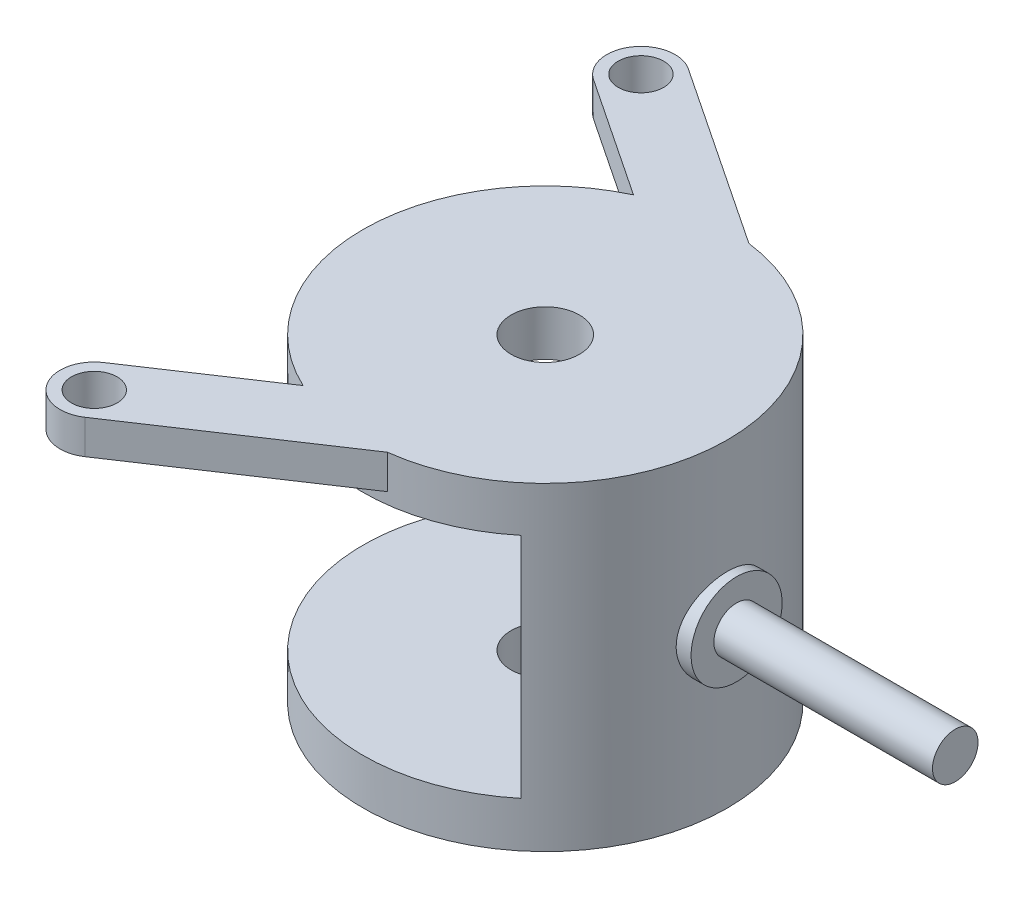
ISO-10303-21;
HEADER;
FILE_DESCRIPTION(('STEP AP214'),'2;1');
FILE_NAME('part.step','',(''),(''),'','','');
FILE_SCHEMA(('AUTOMOTIVE_DESIGN { 1 0 10303 214 1 1 1 1 }'));
ENDSEC;
DATA;
#1=APPLICATION_CONTEXT('core data for automotive mechanical design processes');
#2=APPLICATION_PROTOCOL_DEFINITION('international standard','automotive_design',2000,#1);
#3=PRODUCT_CONTEXT('',#1,'mechanical');
#4=PRODUCT('Part','Part','',(#3));
#5=PRODUCT_RELATED_PRODUCT_CATEGORY('part','',(#4));
#6=PRODUCT_DEFINITION_FORMATION('','',#4);
#7=PRODUCT_DEFINITION_CONTEXT('part definition',#1,'design');
#8=PRODUCT_DEFINITION('design','',#6,#7);
#9=PRODUCT_DEFINITION_SHAPE('','',#8);
#10=(LENGTH_UNIT() NAMED_UNIT(*) SI_UNIT(.MILLI.,.METRE.));
#11=(NAMED_UNIT(*) PLANE_ANGLE_UNIT() SI_UNIT($,.RADIAN.));
#12=(NAMED_UNIT(*) SI_UNIT($,.STERADIAN.) SOLID_ANGLE_UNIT());
#13=UNCERTAINTY_MEASURE_WITH_UNIT(LENGTH_MEASURE(1.E-05),#10,'distance_accuracy_value','');
#14=(GEOMETRIC_REPRESENTATION_CONTEXT(3) GLOBAL_UNCERTAINTY_ASSIGNED_CONTEXT((#13)) GLOBAL_UNIT_ASSIGNED_CONTEXT((#10,
#11,#12)) REPRESENTATION_CONTEXT('',''));
#15=CARTESIAN_POINT('',(0.,0.,0.));
#16=DIRECTION('',(0.,0.,1.));
#17=DIRECTION('',(1.,0.,0.));
#18=AXIS2_PLACEMENT_3D('',#15,#16,#17);
#19=CARTESIAN_POINT('',(530.,-273.519212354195,-50.0000000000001));
#20=DIRECTION('',(0.,-1.,0.));
#21=DIRECTION('',(1.,0.,0.));
#22=AXIS2_PLACEMENT_3D('',#19,#20,#21);
#23=CYLINDRICAL_SURFACE('',#22,80.0000000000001);
#24=DIRECTION('',(0.,-1.,0.));
#25=VECTOR('',#24,1.);
#26=CARTESIAN_POINT('',(496.211860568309,460.494129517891,-122.51456152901));
#27=LINE('',#26,#25);
#28=CARTESIAN_POINT('',(496.211860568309,340.,-122.51456152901));
#29=VERTEX_POINT('',#28);
#30=CARTESIAN_POINT('',(496.211860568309,325.,-122.51456152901));
#31=VERTEX_POINT('',#30);
#32=EDGE_CURVE('E62',#29,#31,#27,.T.);
#33=ORIENTED_EDGE('',*,*,#32,.T.);
#34=CARTESIAN_POINT('',(530.,325.,-50.0000000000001));
#35=DIRECTION('',(0.,1.,0.));
#36=DIRECTION('',(0.,0.,1.));
#37=AXIS2_PLACEMENT_3D('',#34,#35,#36);
#38=CIRCLE('',#37,80.0000000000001);
#39=CARTESIAN_POINT('',(540.026235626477,325.,-129.369229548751));
#40=VERTEX_POINT('',#39);
#41=EDGE_CURVE('E57',#40,#31,#38,.T.);
#42=ORIENTED_EDGE('',*,*,#41,.F.);
#43=DIRECTION('',(0.,-1.,0.));
#44=VECTOR('',#43,1.);
#45=CARTESIAN_POINT('',(540.026235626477,460.494129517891,-129.369229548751));
#46=LINE('',#45,#44);
#47=CARTESIAN_POINT('',(540.026235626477,340.,-129.369229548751));
#48=VERTEX_POINT('',#47);
#49=EDGE_CURVE('E129',#48,#40,#46,.T.);
#50=ORIENTED_EDGE('',*,*,#49,.F.);
#51=CARTESIAN_POINT('',(530.,340.,-50.0000000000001));
#52=DIRECTION('',(0.,-1.,0.));
#53=DIRECTION('',(1.,0.,0.));
#54=AXIS2_PLACEMENT_3D('',#51,#52,#53);
#55=CIRCLE('',#54,80.0000000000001);
#56=CARTESIAN_POINT('',(540.026235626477,340.,29.3692295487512));
#57=VERTEX_POINT('',#56);
#58=EDGE_CURVE('E117',#48,#57,#55,.T.);
#59=ORIENTED_EDGE('',*,*,#58,.T.);
#60=DIRECTION('',(0.,-1.,0.));
#61=VECTOR('',#60,1.);
#62=CARTESIAN_POINT('',(540.026235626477,460.494129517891,29.3692295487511));
#63=LINE('',#62,#61);
#64=CARTESIAN_POINT('',(540.026235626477,325.,29.3692295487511));
#65=VERTEX_POINT('',#64);
#66=EDGE_CURVE('E176',#57,#65,#63,.T.);
#67=ORIENTED_EDGE('',*,*,#66,.T.);
#68=CARTESIAN_POINT('',(530.,325.,-50.0000000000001));
#69=DIRECTION('',(0.,1.,0.));
#70=DIRECTION('',(0.,0.,-1.));
#71=AXIS2_PLACEMENT_3D('',#68,#69,#70);
#72=CIRCLE('',#71,80.0000000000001);
#73=CARTESIAN_POINT('',(496.211860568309,325.,22.5145615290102));
#74=VERTEX_POINT('',#73);
#75=EDGE_CURVE('E157',#74,#65,#72,.T.);
#76=ORIENTED_EDGE('',*,*,#75,.F.);
#77=DIRECTION('',(0.,-1.,0.));
#78=VECTOR('',#77,1.);
#79=CARTESIAN_POINT('',(496.211860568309,460.494129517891,22.5145615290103));
#80=LINE('',#79,#78);
#81=CARTESIAN_POINT('',(496.211860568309,340.,22.5145615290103));
#82=VERTEX_POINT('',#81);
#83=EDGE_CURVE('E169',#82,#74,#80,.T.);
#84=ORIENTED_EDGE('',*,*,#83,.F.);
#85=EDGE_CURVE('E126',#82,#29,#55,.T.);
#86=ORIENTED_EDGE('',*,*,#85,.T.);
#87=EDGE_LOOP('',(#33,#42,#50,#59,#67,#76,#84,#86));
#88=FACE_BOUND('',#87,.T.);
#89=CARTESIAN_POINT('',(530.,200.,-50.0000000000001));
#90=DIRECTION('',(0.,-1.,0.));
#91=DIRECTION('',(1.,0.,0.));
#92=AXIS2_PLACEMENT_3D('',#89,#90,#91);
#93=CIRCLE('',#92,80.0000000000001);
#94=CARTESIAN_POINT('',(610.,200.,-50.0000000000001));
#95=VERTEX_POINT('',#94);
#96=EDGE_CURVE('E212',#95,#95,#93,.T.);
#97=ORIENTED_EDGE('',*,*,#96,.F.);
#98=EDGE_LOOP('',(#97));
#99=FACE_BOUND('',#98,.T.);
#100=CARTESIAN_POINT('',(530.,220.,-50.0000000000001));
#101=DIRECTION('',(0.,-1.,0.));
#102=DIRECTION('',(0.,0.,-1.));
#103=AXIS2_PLACEMENT_3D('',#100,#101,#102);
#104=CIRCLE('',#103,80.0000000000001);
#105=CARTESIAN_POINT('',(581.,220.,-111.63602842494));
#106=VERTEX_POINT('',#105);
#107=CARTESIAN_POINT('',(581.,220.,11.6360284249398));
#108=VERTEX_POINT('',#107);
#109=EDGE_CURVE('E127',#106,#108,#104,.F.);
#110=ORIENTED_EDGE('',*,*,#109,.F.);
#111=DIRECTION('',(0.,-1.,0.));
#112=VECTOR('',#111,1.);
#113=CARTESIAN_POINT('',(581.,-273.519212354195,-111.63602842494));
#114=LINE('',#113,#112);
#115=CARTESIAN_POINT('',(581.,320.,-111.63602842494));
#116=VERTEX_POINT('',#115);
#117=EDGE_CURVE('E50',#116,#106,#114,.T.);
#118=ORIENTED_EDGE('',*,*,#117,.F.);
#119=CARTESIAN_POINT('',(530.,320.,-50.0000000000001));
#120=DIRECTION('',(0.,1.,0.));
#121=DIRECTION('',(0.,0.,1.));
#122=AXIS2_PLACEMENT_3D('',#119,#120,#121);
#123=CIRCLE('',#122,80.0000000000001);
#124=CARTESIAN_POINT('',(581.,320.,11.6360284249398));
#125=VERTEX_POINT('',#124);
#126=EDGE_CURVE('E202',#125,#116,#123,.F.);
#127=ORIENTED_EDGE('',*,*,#126,.F.);
#128=DIRECTION('',(0.,-1.,0.));
#129=VECTOR('',#128,1.);
#130=CARTESIAN_POINT('',(581.,-273.519212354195,11.6360284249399));
#131=LINE('',#130,#129);
#132=EDGE_CURVE('E11',#108,#125,#131,.F.);
#133=ORIENTED_EDGE('',*,*,#132,.F.);
#134=EDGE_LOOP('',(#110,#118,#127,#133));
#135=FACE_BOUND('',#134,.T.);
#136=CARTESIAN_POINT('',(610.,290.,-50.0000000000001));
#137=CARTESIAN_POINT('',(609.999998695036,289.999997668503,-50.5525533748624));
#138=CARTESIAN_POINT('',(609.994261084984,289.977082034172,-51.1051535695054));
#139=CARTESIAN_POINT('',(609.971466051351,289.885605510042,-52.2063629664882));
#140=CARTESIAN_POINT('',(609.954407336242,289.817039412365,-52.7549717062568));
#141=CARTESIAN_POINT('',(609.909432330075,289.634794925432,-53.8444803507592));
#142=CARTESIAN_POINT('',(609.881510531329,289.521093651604,-54.3853762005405));
#143=CARTESIAN_POINT('',(609.815580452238,289.249524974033,-55.455311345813));
#144=CARTESIAN_POINT('',(609.777572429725,289.091658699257,-55.984350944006));
#145=CARTESIAN_POINT('',(609.692560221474,288.733243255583,-57.0262905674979));
#146=CARTESIAN_POINT('',(609.645567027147,288.532746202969,-57.5392094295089));
#147=CARTESIAN_POINT('',(609.543822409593,288.090493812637,-58.5461345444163));
#148=CARTESIAN_POINT('',(609.489070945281,287.848738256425,-59.0401406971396));
#149=CARTESIAN_POINT('',(609.373272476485,287.325743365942,-60.0060096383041));
#150=CARTESIAN_POINT('',(609.312225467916,287.044504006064,-60.4778724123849));
#151=CARTESIAN_POINT('',(609.185453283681,286.444511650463,-61.3964465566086));
#152=CARTESIAN_POINT('',(609.119728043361,286.125758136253,-61.8431575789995));
#153=CARTESIAN_POINT('',(608.984089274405,285.446652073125,-62.7166269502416));
#154=CARTESIAN_POINT('',(608.914120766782,285.085639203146,-63.1428634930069));
#155=CARTESIAN_POINT('',(608.773042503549,284.329347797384,-63.9635663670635));
#156=CARTESIAN_POINT('',(608.701932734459,283.934068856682,-64.3580323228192));
#157=CARTESIAN_POINT('',(608.560519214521,283.111795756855,-65.1126515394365));
#158=CARTESIAN_POINT('',(608.490215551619,282.684798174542,-65.4728010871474));
#159=CARTESIAN_POINT('',(608.352374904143,281.801895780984,-66.15632819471));
#160=CARTESIAN_POINT('',(608.28483793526,281.345990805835,-66.4797055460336));
#161=CARTESIAN_POINT('',(608.153463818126,280.401245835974,-67.091975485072));
#162=CARTESIAN_POINT('',(608.089696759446,279.912016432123,-67.3802827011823));
#163=CARTESIAN_POINT('',(607.968863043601,278.910153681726,-67.9145598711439));
#164=CARTESIAN_POINT('',(607.911796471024,278.397520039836,-68.1605292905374));
#165=CARTESIAN_POINT('',(607.806098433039,277.352489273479,-68.6081694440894));
#166=CARTESIAN_POINT('',(607.757465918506,276.820094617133,-68.8098456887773));
#167=CARTESIAN_POINT('',(607.670133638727,275.739312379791,-69.1672697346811));
#168=CARTESIAN_POINT('',(607.631433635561,275.190925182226,-69.3230186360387));
#169=CARTESIAN_POINT('',(607.565851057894,274.093324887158,-69.5846005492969));
#170=CARTESIAN_POINT('',(607.53874731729,273.544348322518,-69.6913708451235));
#171=CARTESIAN_POINT('',(607.496086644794,272.438940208,-69.8586008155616));
#172=CARTESIAN_POINT('',(607.480529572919,271.882508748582,-69.9190610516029));
#173=CARTESIAN_POINT('',(607.461449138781,270.766409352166,-69.9931329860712));
#174=CARTESIAN_POINT('',(607.457924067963,270.20674188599,-70.0067513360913));
#175=CARTESIAN_POINT('',(607.463013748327,269.088294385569,-69.9870360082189));
#176=CARTESIAN_POINT('',(607.471628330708,268.529514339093,-69.9537029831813));
#177=CARTESIAN_POINT('',(607.50037231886,267.430539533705,-69.8417618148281));
#178=CARTESIAN_POINT('',(607.520217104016,266.890222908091,-69.7642724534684));
#179=CARTESIAN_POINT('',(607.570616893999,265.818221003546,-69.5655280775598));
#180=CARTESIAN_POINT('',(607.60117169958,265.286535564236,-69.4442738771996));
#181=CARTESIAN_POINT('',(607.672101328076,264.235424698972,-69.1589731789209));
#182=CARTESIAN_POINT('',(607.712476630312,263.715999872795,-68.9949245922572));
#183=CARTESIAN_POINT('',(607.801888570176,262.692908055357,-68.6253121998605));
#184=CARTESIAN_POINT('',(607.850925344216,262.189241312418,-68.419747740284));
#185=CARTESIAN_POINT('',(607.956813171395,261.195963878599,-67.9663570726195));
#186=CARTESIAN_POINT('',(608.013737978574,260.706545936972,-67.7181259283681));
#187=CARTESIAN_POINT('',(608.133420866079,259.750291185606,-67.1826589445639));
#188=CARTESIAN_POINT('',(608.196178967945,259.28345445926,-66.8954229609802));
#189=CARTESIAN_POINT('',(608.325812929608,258.375239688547,-66.283878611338));
#190=CARTESIAN_POINT('',(608.392689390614,257.933865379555,-65.9595648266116));
#191=CARTESIAN_POINT('',(608.528746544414,257.07939702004,-65.2760389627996));
#192=CARTESIAN_POINT('',(608.597927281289,256.666303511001,-64.9168262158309));
#193=CARTESIAN_POINT('',(608.738733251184,255.859620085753,-64.1550737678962));
#194=CARTESIAN_POINT('',(608.810371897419,255.466923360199,-63.7515900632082));
#195=CARTESIAN_POINT('',(608.952139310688,254.716806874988,-62.9128067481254));
#196=CARTESIAN_POINT('',(609.022268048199,254.359387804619,-62.4775065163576));
#197=CARTESIAN_POINT('',(609.159068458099,253.682276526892,-61.577945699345));
#198=CARTESIAN_POINT('',(609.225739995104,253.36258579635,-61.1136839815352));
#199=CARTESIAN_POINT('',(609.353766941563,252.763234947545,-60.1593031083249));
#200=CARTESIAN_POINT('',(609.415122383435,252.483574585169,-59.6691841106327));
#201=CARTESIAN_POINT('',(609.531001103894,251.965473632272,-58.6646597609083));
#202=CARTESIAN_POINT('',(609.585499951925,251.727179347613,-58.1501760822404));
#203=CARTESIAN_POINT('',(609.685866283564,251.294879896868,-57.1020990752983));
#204=CARTESIAN_POINT('',(609.73173371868,251.100874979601,-56.5685056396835));
#205=CARTESIAN_POINT('',(609.813512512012,250.758784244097,-55.4861368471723));
#206=CARTESIAN_POINT('',(609.849425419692,250.610691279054,-54.9373638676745));
#207=CARTESIAN_POINT('',(609.910261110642,250.361659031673,-53.828624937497));
#208=CARTESIAN_POINT('',(609.935184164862,250.260718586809,-53.2686592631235));
#209=CARTESIAN_POINT('',(609.972823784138,250.10885105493,-52.1562094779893));
#210=CARTESIAN_POINT('',(609.985836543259,250.056709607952,-51.603900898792));
#211=CARTESIAN_POINT('',(610.000373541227,249.998485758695,-50.4967139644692));
#212=CARTESIAN_POINT('',(610.001897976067,249.992402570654,-49.9418356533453));
#213=CARTESIAN_POINT('',(609.993416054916,250.026345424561,-48.8336284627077));
#214=CARTESIAN_POINT('',(609.983410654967,250.066367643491,-48.2802994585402));
#215=CARTESIAN_POINT('',(609.952150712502,250.192170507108,-47.1791928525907));
#216=CARTESIAN_POINT('',(609.930896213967,250.277950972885,-46.6314152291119));
#217=CARTESIAN_POINT('',(609.878126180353,250.492931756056,-45.5534439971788));
#218=CARTESIAN_POINT('',(609.846767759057,250.621468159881,-45.0231100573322));
#219=CARTESIAN_POINT('',(609.774551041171,250.921212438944,-43.9753180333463));
#220=CARTESIAN_POINT('',(609.733692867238,251.092419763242,-43.4578597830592));
#221=CARTESIAN_POINT('',(609.643558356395,251.476200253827,-42.4392400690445));
#222=CARTESIAN_POINT('',(609.594281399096,251.688776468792,-41.9380798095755));
#223=CARTESIAN_POINT('',(609.488606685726,252.153716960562,-40.9553507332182));
#224=CARTESIAN_POINT('',(609.432208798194,252.406081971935,-40.4737822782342));
#225=CARTESIAN_POINT('',(609.312710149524,252.953633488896,-39.524948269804));
#226=CARTESIAN_POINT('',(609.249508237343,253.249500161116,-39.0580879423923));
#227=CARTESIAN_POINT('',(609.118943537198,253.878528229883,-38.1508286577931));
#228=CARTESIAN_POINT('',(609.051580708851,254.211689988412,-37.7104299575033));
#229=CARTESIAN_POINT('',(608.91448286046,254.913121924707,-36.8588256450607));
#230=CARTESIAN_POINT('',(608.844747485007,255.281397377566,-36.4476244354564));
#231=CARTESIAN_POINT('',(608.704779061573,256.050618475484,-35.6570948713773));
#232=CARTESIAN_POINT('',(608.634546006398,256.451564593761,-35.2777669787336));
#233=CARTESIAN_POINT('',(608.493763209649,257.293804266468,-34.5445172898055));
#234=CARTESIAN_POINT('',(608.423248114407,257.735847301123,-34.1914491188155));
#235=CARTESIAN_POINT('',(608.285697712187,258.6486132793,-33.5237820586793));
#236=CARTESIAN_POINT('',(608.218662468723,259.119336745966,-33.2091838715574));
#237=CARTESIAN_POINT('',(608.090024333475,260.086299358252,-32.6207352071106));
#238=CARTESIAN_POINT('',(608.028421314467,260.58253790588,-32.3468837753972));
#239=CARTESIAN_POINT('',(607.912475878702,261.59715296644,-31.8419924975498));
#240=CARTESIAN_POINT('',(607.858133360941,262.115529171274,-31.6109520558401));
#241=CARTESIAN_POINT('',(607.758657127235,263.167626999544,-31.1947672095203));
#242=CARTESIAN_POINT('',(607.713470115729,263.701237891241,-31.0093557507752));
#243=CARTESIAN_POINT('',(607.633283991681,264.782946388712,-30.6841697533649));
#244=CARTESIAN_POINT('',(607.598284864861,265.331043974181,-30.5443951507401));
#245=CARTESIAN_POINT('',(607.539574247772,266.43759343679,-30.3117078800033));
#246=CARTESIAN_POINT('',(607.515860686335,266.996043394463,-30.2187866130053));
#247=CARTESIAN_POINT('',(607.480465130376,268.119182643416,-30.0805964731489));
#248=CARTESIAN_POINT('',(607.468782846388,268.683871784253,-30.035326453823));
#249=CARTESIAN_POINT('',(607.457979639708,269.798895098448,-29.9934555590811));
#250=CARTESIAN_POINT('',(607.458507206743,270.349175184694,-29.9954927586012));
#251=CARTESIAN_POINT('',(607.471245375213,271.447553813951,-30.0448805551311));
#252=CARTESIAN_POINT('',(607.483455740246,271.995652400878,-30.0922302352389));
#253=CARTESIAN_POINT('',(607.519190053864,273.085705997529,-30.2318350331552));
#254=CARTESIAN_POINT('',(607.54271370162,273.627661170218,-30.324088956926));
#255=CARTESIAN_POINT('',(607.600370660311,274.701602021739,-30.5527289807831));
#256=CARTESIAN_POINT('',(607.63450402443,275.23358765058,-30.6891153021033));
#257=CARTESIAN_POINT('',(607.712140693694,276.280752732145,-31.0039665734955));
#258=CARTESIAN_POINT('',(607.755586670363,276.796013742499,-31.1821746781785));
#259=CARTESIAN_POINT('',(607.850725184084,277.809611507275,-31.5797304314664));
#260=CARTESIAN_POINT('',(607.902417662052,278.30794838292,-31.7990777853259));
#261=CARTESIAN_POINT('',(608.012609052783,279.284537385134,-32.2773304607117));
#262=CARTESIAN_POINT('',(608.071108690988,279.762787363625,-32.5362399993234));
#263=CARTESIAN_POINT('',(608.193308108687,280.696146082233,-33.0917940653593));
#264=CARTESIAN_POINT('',(608.257007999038,281.151254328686,-33.3884393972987));
#265=CARTESIAN_POINT('',(608.389606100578,282.047061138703,-34.0256992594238));
#266=CARTESIAN_POINT('',(608.458596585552,282.487073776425,-34.3672591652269));
#267=CARTESIAN_POINT('',(608.598334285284,283.336937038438,-35.085720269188));
#268=CARTESIAN_POINT('',(608.669081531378,283.746787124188,-35.4626220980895));
#269=CARTESIAN_POINT('',(608.810406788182,284.533758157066,-36.2493811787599));
#270=CARTESIAN_POINT('',(608.880984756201,284.910871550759,-36.6592459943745));
#271=CARTESIAN_POINT('',(609.0200312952,285.62977137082,-37.5092010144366));
#272=CARTESIAN_POINT('',(609.08849986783,285.971557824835,-37.9492911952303));
#273=CARTESIAN_POINT('',(609.222673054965,286.623342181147,-38.8650969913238));
#274=CARTESIAN_POINT('',(609.288305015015,286.932651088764,-39.3413139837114));
#275=CARTESIAN_POINT('',(609.413600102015,287.509977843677,-40.318938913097));
#276=CARTESIAN_POINT('',(609.473262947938,287.777993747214,-40.8203480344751));
#277=CARTESIAN_POINT('',(609.584882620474,288.270496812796,-41.8445336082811));
#278=CARTESIAN_POINT('',(609.636844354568,288.495011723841,-42.3672961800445));
#279=CARTESIAN_POINT('',(609.731609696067,288.898893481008,-43.4307372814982));
#280=CARTESIAN_POINT('',(609.774414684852,289.07826713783,-43.9714130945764));
#281=CARTESIAN_POINT('',(609.84253578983,289.360928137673,-44.9633363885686));
#282=CARTESIAN_POINT('',(609.869627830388,289.472185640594,-45.4122101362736));
#283=CARTESIAN_POINT('',(609.91646513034,289.663418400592,-46.3170887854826));
#284=CARTESIAN_POINT('',(609.9362085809,289.743385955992,-46.7730954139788));
#285=CARTESIAN_POINT('',(609.967951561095,289.871515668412,-47.6897961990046));
#286=CARTESIAN_POINT('',(609.979951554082,289.919679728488,-48.1504900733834));
#287=CARTESIAN_POINT('',(609.995975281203,289.983918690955,-49.0741120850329));
#288=CARTESIAN_POINT('',(610.000001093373,290.00000195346,-49.5370396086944));
#289=CARTESIAN_POINT('',(610.,290.,-50.0000000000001));
#290=B_SPLINE_CURVE_WITH_KNOTS('',3,(#136,#137,#138,#139,#140,#141,#142,#143,#144,#145,#146,
#147,#148,#149,#150,#151,#152,#153,#154,#155,#156,#157,#158,#159,#160,#161,#162,#163,#164,#165,
#166,#167,#168,#169,#170,#171,#172,#173,#174,#175,#176,#177,#178,#179,#180,#181,#182,#183,#184,
#185,#186,#187,#188,#189,#190,#191,#192,#193,#194,#195,#196,#197,#198,#199,#200,#201,#202,#203,
#204,#205,#206,#207,#208,#209,#210,#211,#212,#213,#214,#215,#216,#217,#218,#219,#220,#221,#222,
#223,#224,#225,#226,#227,#228,#229,#230,#231,#232,#233,#234,#235,#236,#237,#238,#239,#240,#241,
#242,#243,#244,#245,#246,#247,#248,#249,#250,#251,#252,#253,#254,#255,#256,#257,#258,#259,#260,
#261,#262,#263,#264,#265,#266,#267,#268,#269,#270,#271,#272,#273,#274,#275,#276,#277,#278,#279,
#280,#281,#282,#283,#284,#285,#286,#287,#288,#289),.UNSPECIFIED.,.T.,.F.,(4,2,2,2,2,2,2,2,2,2,2,
2,2,2,2,2,2,2,2,2,2,2,2,2,2,2,2,2,2,2,2,2,2,2,2,2,2,2,2,2,2,2,2,2,2,2,2,2,2,2,2,2,2,2,2,2,2,2,2,
2,2,2,2,2,2,2,2,2,2,2,2,2,2,2,2,2,4),(0.,1.65723817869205,3.31466545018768,4.97293415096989,
6.63116046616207,8.28737113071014,9.94359056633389,11.5998110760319,13.2560544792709,
14.9429290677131,16.629823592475,18.3169004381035,20.0039868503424,21.7162015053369,
23.4284377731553,25.140460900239,26.8524430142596,28.5301358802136,30.2078084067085,
31.8852426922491,33.562653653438,35.1993423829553,36.8360006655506,38.4727388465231,
40.1095028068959,41.7627578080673,43.4160189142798,45.0695219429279,46.7230566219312,
48.4237862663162,50.1245491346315,51.8253785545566,53.5261976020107,55.2329147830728,
56.9396415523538,58.6461025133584,60.3525214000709,62.0152494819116,63.6779491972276,
65.3405110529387,67.0030664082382,68.6409251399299,70.2787627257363,71.9167210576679,
73.5547096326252,75.221752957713,76.888812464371,78.5561228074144,80.2234573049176,
81.9317734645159,83.6401207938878,85.3484281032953,87.0567116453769,88.7547456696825,
90.4527773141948,92.15049720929,93.8481762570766,95.4970431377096,97.1458766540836,
98.7946663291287,100.443464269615,102.08238965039,103.7213032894,105.360391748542,
106.999515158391,108.681411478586,110.363337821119,112.045651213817,113.727963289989,
115.440788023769,117.153693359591,118.86550242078,120.577053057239,121.965684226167,
123.354656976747,124.74354660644,126.132074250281),.UNSPECIFIED.);
#291=CARTESIAN_POINT('',(610.,290.,-50.0000000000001));
#292=VERTEX_POINT('',#291);
#293=EDGE_CURVE('E41',#292,#292,#290,.T.);
#294=ORIENTED_EDGE('',*,*,#293,.T.);
#295=EDGE_LOOP('',(#294));
#296=FACE_BOUND('',#295,.T.);
#297=ADVANCED_FACE('F37',(#88,#99,#135,#296),#23,.T.);
#298=CARTESIAN_POINT('',(530.,-273.519212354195,-50.0000000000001));
#299=DIRECTION('',(0.,-1.,0.));
#300=DIRECTION('',(1.,0.,0.));
#301=AXIS2_PLACEMENT_3D('',#298,#299,#300);
#302=CYLINDRICAL_SURFACE('',#301,15.0000000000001);
#303=CARTESIAN_POINT('',(530.,220.,-50.0000000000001));
#304=DIRECTION('',(0.,-1.,0.));
#305=DIRECTION('',(0.,0.,-1.));
#306=AXIS2_PLACEMENT_3D('',#303,#304,#305);
#307=CIRCLE('',#306,15.0000000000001);
#308=CARTESIAN_POINT('',(530.,220.,-65.0000000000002));
#309=VERTEX_POINT('',#308);
#310=EDGE_CURVE('E204',#309,#309,#307,.T.);
#311=ORIENTED_EDGE('',*,*,#310,.F.);
#312=EDGE_LOOP('',(#311));
#313=FACE_BOUND('',#312,.T.);
#314=CARTESIAN_POINT('',(530.,200.,-50.0000000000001));
#315=DIRECTION('',(0.,-1.,0.));
#316=DIRECTION('',(1.,0.,0.));
#317=AXIS2_PLACEMENT_3D('',#314,#315,#316);
#318=CIRCLE('',#317,15.0000000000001);
#319=CARTESIAN_POINT('',(545.,200.,-50.0000000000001));
#320=VERTEX_POINT('',#319);
#321=EDGE_CURVE('E209',#320,#320,#318,.T.);
#322=ORIENTED_EDGE('',*,*,#321,.T.);
#323=EDGE_LOOP('',(#322));
#324=FACE_BOUND('',#323,.T.);
#325=ADVANCED_FACE('F245',(#313,#324),#302,.F.);
#326=CARTESIAN_POINT('',(610.,200.,-50.0000000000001));
#327=DIRECTION('',(0.,-1.,0.));
#328=DIRECTION('',(1.,0.,0.));
#329=AXIS2_PLACEMENT_3D('',#326,#327,#328);
#330=PLANE('',#329);
#331=ORIENTED_EDGE('',*,*,#96,.T.);
#332=EDGE_LOOP('',(#331));
#333=FACE_BOUND('',#332,.T.);
#334=ORIENTED_EDGE('',*,*,#321,.F.);
#335=EDGE_LOOP('',(#334));
#336=FACE_BOUND('',#335,.T.);
#337=ADVANCED_FACE('F243',(#333,#336),#330,.T.);
#338=CARTESIAN_POINT('',(530.,320.,-50.0000000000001));
#339=DIRECTION('',(0.,1.,0.));
#340=DIRECTION('',(0.,0.,1.));
#341=AXIS2_PLACEMENT_3D('',#338,#339,#340);
#342=CIRCLE('',#341,15.0000000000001);
#343=CARTESIAN_POINT('',(530.,320.,-35.));
#344=VERTEX_POINT('',#343);
#345=EDGE_CURVE('E199',#344,#344,#342,.T.);
#346=ORIENTED_EDGE('',*,*,#345,.F.);
#347=EDGE_LOOP('',(#346));
#348=FACE_BOUND('',#347,.T.);
#349=CARTESIAN_POINT('',(530.,340.,-50.0000000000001));
#350=DIRECTION('',(0.,-1.,0.));
#351=DIRECTION('',(1.,0.,0.));
#352=AXIS2_PLACEMENT_3D('',#349,#350,#351);
#353=CIRCLE('',#352,15.0000000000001);
#354=CARTESIAN_POINT('',(545.,340.,-50.0000000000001));
#355=VERTEX_POINT('',#354);
#356=EDGE_CURVE('E206',#355,#355,#353,.T.);
#357=ORIENTED_EDGE('',*,*,#356,.F.);
#358=EDGE_LOOP('',(#357));
#359=FACE_BOUND('',#358,.T.);
#360=ADVANCED_FACE('F240',(#348,#359),#302,.F.);
#361=CARTESIAN_POINT('',(610.,340.,-50.0000000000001));
#362=DIRECTION('',(0.,1.,0.));
#363=DIRECTION('',(-1.,0.,0.));
#364=AXIS2_PLACEMENT_3D('',#361,#362,#363);
#365=PLANE('',#364);
#366=ORIENTED_EDGE('',*,*,#356,.T.);
#367=EDGE_LOOP('',(#366));
#368=FACE_BOUND('',#367,.T.);
#369=ORIENTED_EDGE('',*,*,#85,.F.);
#370=DIRECTION('',(0.832173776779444,0.,-0.554514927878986));
#371=VECTOR('',#370,1.);
#372=CARTESIAN_POINT('',(443.682276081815,340.,57.5173933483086));
#373=LINE('',#372,#371);
#374=CARTESIAN_POINT('',(443.682276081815,340.,57.5173933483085));
#375=VERTEX_POINT('',#374);
#376=EDGE_CURVE('E173',#375,#82,#373,.T.);
#377=ORIENTED_EDGE('',*,*,#376,.F.);
#378=CARTESIAN_POINT('',(452.,340.,70.0000000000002));
#379=DIRECTION('',(0.,1.,0.));
#380=DIRECTION('',(-1.,0.,0.));
#381=AXIS2_PLACEMENT_3D('',#378,#379,#380);
#382=CIRCLE('',#381,15.);
#383=CARTESIAN_POINT('',(460.317723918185,340.,82.4826066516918));
#384=VERTEX_POINT('',#383);
#385=EDGE_CURVE('E177',#384,#375,#382,.F.);
#386=ORIENTED_EDGE('',*,*,#385,.F.);
#387=DIRECTION('',(-0.832173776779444,0.,0.554514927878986));
#388=VECTOR('',#387,1.);
#389=CARTESIAN_POINT('',(540.026235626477,340.,29.3692295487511));
#390=LINE('',#389,#388);
#391=EDGE_CURVE('E124',#57,#384,#390,.T.);
#392=ORIENTED_EDGE('',*,*,#391,.F.);
#393=ORIENTED_EDGE('',*,*,#58,.F.);
#394=DIRECTION('',(0.832173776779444,0.,0.554514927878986));
#395=VECTOR('',#394,1.);
#396=CARTESIAN_POINT('',(540.026235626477,340.,-129.369229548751));
#397=LINE('',#396,#395);
#398=CARTESIAN_POINT('',(460.317723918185,340.,-182.482606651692));
#399=VERTEX_POINT('',#398);
#400=EDGE_CURVE('E121',#399,#48,#397,.T.);
#401=ORIENTED_EDGE('',*,*,#400,.F.);
#402=CARTESIAN_POINT('',(452.,340.,-170.));
#403=DIRECTION('',(0.,1.,0.));
#404=DIRECTION('',(-1.,0.,0.));
#405=AXIS2_PLACEMENT_3D('',#402,#403,#404);
#406=CIRCLE('',#405,15.);
#407=CARTESIAN_POINT('',(443.682276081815,340.,-157.517393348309));
#408=VERTEX_POINT('',#407);
#409=EDGE_CURVE('E146',#408,#399,#406,.F.);
#410=ORIENTED_EDGE('',*,*,#409,.F.);
#411=DIRECTION('',(-0.832173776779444,0.,-0.554514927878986));
#412=VECTOR('',#411,1.);
#413=CARTESIAN_POINT('',(443.682276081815,340.,-157.517393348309));
#414=LINE('',#413,#412);
#415=EDGE_CURVE('E148',#29,#408,#414,.T.);
#416=ORIENTED_EDGE('',*,*,#415,.F.);
#417=EDGE_LOOP('',(#369,#377,#386,#392,#393,#401,#410,#416));
#418=FACE_BOUND('',#417,.T.);
#419=CARTESIAN_POINT('',(452.,340.,70.0000000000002));
#420=DIRECTION('',(0.,1.,0.));
#421=DIRECTION('',(-1.,0.,0.));
#422=AXIS2_PLACEMENT_3D('',#419,#420,#421);
#423=CIRCLE('',#422,10.);
#424=CARTESIAN_POINT('',(442.,340.,70.0000000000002));
#425=VERTEX_POINT('',#424);
#426=EDGE_CURVE('E156',#425,#425,#423,.F.);
#427=ORIENTED_EDGE('',*,*,#426,.T.);
#428=EDGE_LOOP('',(#427));
#429=FACE_BOUND('',#428,.T.);
#430=CARTESIAN_POINT('',(452.,340.,-170.));
#431=DIRECTION('',(0.,1.,0.));
#432=DIRECTION('',(-1.,0.,0.));
#433=AXIS2_PLACEMENT_3D('',#430,#431,#432);
#434=CIRCLE('',#433,10.);
#435=CARTESIAN_POINT('',(442.,340.,-170.));
#436=VERTEX_POINT('',#435);
#437=EDGE_CURVE('E144',#436,#436,#434,.F.);
#438=ORIENTED_EDGE('',*,*,#437,.T.);
#439=EDGE_LOOP('',(#438));
#440=FACE_BOUND('',#439,.T.);
#441=ADVANCED_FACE('F118',(#368,#418,#429,#440),#365,.T.);
#442=CARTESIAN_POINT('',(581.,220.,-150.));
#443=DIRECTION('',(1.,0.,0.));
#444=DIRECTION('',(0.,0.,-1.));
#445=AXIS2_PLACEMENT_3D('',#442,#443,#444);
#446=PLANE('',#445);
#447=ORIENTED_EDGE('',*,*,#132,.T.);
#448=DIRECTION('',(0.,0.,1.));
#449=VECTOR('',#448,1.);
#450=CARTESIAN_POINT('',(581.,320.,-150.));
#451=LINE('',#450,#449);
#452=EDGE_CURVE('E200',#116,#125,#451,.T.);
#453=ORIENTED_EDGE('',*,*,#452,.F.);
#454=ORIENTED_EDGE('',*,*,#117,.T.);
#455=DIRECTION('',(0.,0.,1.));
#456=VECTOR('',#455,1.);
#457=CARTESIAN_POINT('',(581.,220.,-150.));
#458=LINE('',#457,#456);
#459=EDGE_CURVE('E196',#106,#108,#458,.T.);
#460=ORIENTED_EDGE('',*,*,#459,.T.);
#461=EDGE_LOOP('',(#447,#453,#454,#460));
#462=FACE_BOUND('',#461,.T.);
#463=ADVANCED_FACE('F223',(#462),#446,.F.);
#464=CARTESIAN_POINT('',(381.,220.,-150.));
#465=DIRECTION('',(0.,-1.,0.));
#466=DIRECTION('',(0.,0.,-1.));
#467=AXIS2_PLACEMENT_3D('',#464,#465,#466);
#468=PLANE('',#467);
#469=ORIENTED_EDGE('',*,*,#109,.T.);
#470=ORIENTED_EDGE('',*,*,#459,.F.);
#471=EDGE_LOOP('',(#469,#470));
#472=FACE_BOUND('',#471,.T.);
#473=ORIENTED_EDGE('',*,*,#310,.T.);
#474=EDGE_LOOP('',(#473));
#475=FACE_BOUND('',#474,.T.);
#476=ADVANCED_FACE('F229',(#472,#475),#468,.F.);
#477=CARTESIAN_POINT('',(381.,320.,-150.));
#478=DIRECTION('',(0.,1.,0.));
#479=DIRECTION('',(0.,0.,1.));
#480=AXIS2_PLACEMENT_3D('',#477,#478,#479);
#481=PLANE('',#480);
#482=ORIENTED_EDGE('',*,*,#126,.T.);
#483=ORIENTED_EDGE('',*,*,#452,.T.);
#484=EDGE_LOOP('',(#482,#483));
#485=FACE_BOUND('',#484,.T.);
#486=ORIENTED_EDGE('',*,*,#345,.T.);
#487=EDGE_LOOP('',(#486));
#488=FACE_BOUND('',#487,.T.);
#489=ADVANCED_FACE('F233',(#485,#488),#481,.F.);
#490=CARTESIAN_POINT('',(710.,270.,-50.0000000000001));
#491=DIRECTION('',(-1.,0.,0.));
#492=DIRECTION('',(0.,0.,1.));
#493=AXIS2_PLACEMENT_3D('',#490,#491,#492);
#494=PLANE('',#493);
#495=CARTESIAN_POINT('',(710.,270.,-50.0000000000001));
#496=DIRECTION('',(-1.,0.,0.));
#497=DIRECTION('',(0.,0.,1.));
#498=AXIS2_PLACEMENT_3D('',#495,#496,#497);
#499=CIRCLE('',#498,10.);
#500=CARTESIAN_POINT('',(710.,270.,-40.0000000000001));
#501=VERTEX_POINT('',#500);
#502=EDGE_CURVE('E193',#501,#501,#499,.T.);
#503=ORIENTED_EDGE('',*,*,#502,.F.);
#504=EDGE_LOOP('',(#503));
#505=FACE_BOUND('',#504,.T.);
#506=ADVANCED_FACE('F236',(#505),#494,.F.);
#507=CARTESIAN_POINT('',(610.,270.,-50.0000000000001));
#508=DIRECTION('',(-1.,0.,0.));
#509=DIRECTION('',(0.,0.,1.));
#510=AXIS2_PLACEMENT_3D('',#507,#508,#509);
#511=CYLINDRICAL_SURFACE('',#510,10.);
#512=CARTESIAN_POINT('',(614.,270.,-50.0000000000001));
#513=DIRECTION('',(-1.,0.,0.));
#514=DIRECTION('',(0.,0.,1.));
#515=AXIS2_PLACEMENT_3D('',#512,#513,#514);
#516=CIRCLE('',#515,10.);
#517=CARTESIAN_POINT('',(614.,270.,-40.0000000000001));
#518=VERTEX_POINT('',#517);
#519=EDGE_CURVE('E190',#518,#518,#516,.T.);
#520=ORIENTED_EDGE('',*,*,#519,.F.);
#521=EDGE_LOOP('',(#520));
#522=FACE_BOUND('',#521,.T.);
#523=ORIENTED_EDGE('',*,*,#502,.T.);
#524=EDGE_LOOP('',(#523));
#525=FACE_BOUND('',#524,.T.);
#526=ADVANCED_FACE('F274',(#522,#525),#511,.T.);
#527=CARTESIAN_POINT('',(614.,290.,-50.0000000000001));
#528=DIRECTION('',(-1.,0.,0.));
#529=DIRECTION('',(0.,0.,1.));
#530=AXIS2_PLACEMENT_3D('',#527,#528,#529);
#531=PLANE('',#530);
#532=CARTESIAN_POINT('',(614.,270.,-50.0000000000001));
#533=DIRECTION('',(-1.,0.,0.));
#534=DIRECTION('',(0.,0.,1.));
#535=AXIS2_PLACEMENT_3D('',#532,#533,#534);
#536=CIRCLE('',#535,20.);
#537=CARTESIAN_POINT('',(614.,270.,-30.0000000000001));
#538=VERTEX_POINT('',#537);
#539=EDGE_CURVE('E172',#538,#538,#536,.T.);
#540=ORIENTED_EDGE('',*,*,#539,.F.);
#541=EDGE_LOOP('',(#540));
#542=FACE_BOUND('',#541,.T.);
#543=ORIENTED_EDGE('',*,*,#519,.T.);
#544=EDGE_LOOP('',(#543));
#545=FACE_BOUND('',#544,.T.);
#546=ADVANCED_FACE('F278',(#542,#545),#531,.F.);
#547=CARTESIAN_POINT('',(610.,270.,-50.0000000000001));
#548=DIRECTION('',(-1.,0.,0.));
#549=DIRECTION('',(0.,0.,1.));
#550=AXIS2_PLACEMENT_3D('',#547,#548,#549);
#551=CYLINDRICAL_SURFACE('',#550,20.);
#552=ORIENTED_EDGE('',*,*,#293,.F.);
#553=EDGE_LOOP('',(#552));
#554=FACE_BOUND('',#553,.T.);
#555=ORIENTED_EDGE('',*,*,#539,.T.);
#556=EDGE_LOOP('',(#555));
#557=FACE_BOUND('',#556,.T.);
#558=ADVANCED_FACE('F281',(#554,#557),#551,.T.);
#559=CARTESIAN_POINT('',(452.,460.494129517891,70.0000000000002));
#560=DIRECTION('',(0.,-1.,0.));
#561=DIRECTION('',(0.,0.,-1.));
#562=AXIS2_PLACEMENT_3D('',#559,#560,#561);
#563=CYLINDRICAL_SURFACE('',#562,15.);
#564=DIRECTION('',(0.,-1.,0.));
#565=VECTOR('',#564,1.);
#566=CARTESIAN_POINT('',(460.317723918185,460.494129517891,82.4826066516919));
#567=LINE('',#566,#565);
#568=CARTESIAN_POINT('',(460.317723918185,325.,82.4826066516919));
#569=VERTEX_POINT('',#568);
#570=EDGE_CURVE('E182',#384,#569,#567,.T.);
#571=ORIENTED_EDGE('',*,*,#570,.F.);
#572=ORIENTED_EDGE('',*,*,#385,.T.);
#573=DIRECTION('',(0.,-1.,0.));
#574=VECTOR('',#573,1.);
#575=CARTESIAN_POINT('',(443.682276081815,460.494129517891,57.5173933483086));
#576=LINE('',#575,#574);
#577=CARTESIAN_POINT('',(443.682276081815,325.,57.5173933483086));
#578=VERTEX_POINT('',#577);
#579=EDGE_CURVE('E180',#375,#578,#576,.T.);
#580=ORIENTED_EDGE('',*,*,#579,.T.);
#581=CARTESIAN_POINT('',(452.,325.,70.0000000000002));
#582=DIRECTION('',(0.,-1.,0.));
#583=DIRECTION('',(0.,0.,-1.));
#584=AXIS2_PLACEMENT_3D('',#581,#582,#583);
#585=CIRCLE('',#584,15.);
#586=EDGE_CURVE('E163',#569,#578,#585,.T.);
#587=ORIENTED_EDGE('',*,*,#586,.F.);
#588=EDGE_LOOP('',(#571,#572,#580,#587));
#589=FACE_BOUND('',#588,.T.);
#590=ADVANCED_FACE('F286',(#589),#563,.T.);
#591=CARTESIAN_POINT('',(540.026235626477,460.494129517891,29.3692295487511));
#592=DIRECTION('',(0.554514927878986,0.,0.832173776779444));
#593=DIRECTION('',(0.832173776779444,0.,-0.554514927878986));
#594=AXIS2_PLACEMENT_3D('',#591,#592,#593);
#595=PLANE('',#594);
#596=ORIENTED_EDGE('',*,*,#66,.F.);
#597=ORIENTED_EDGE('',*,*,#391,.T.);
#598=ORIENTED_EDGE('',*,*,#570,.T.);
#599=DIRECTION('',(-0.832173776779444,0.,0.554514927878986));
#600=VECTOR('',#599,1.);
#601=CARTESIAN_POINT('',(540.026235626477,325.,29.3692295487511));
#602=LINE('',#601,#600);
#603=EDGE_CURVE('E153',#65,#569,#602,.T.);
#604=ORIENTED_EDGE('',*,*,#603,.F.);
#605=EDGE_LOOP('',(#596,#597,#598,#604));
#606=FACE_BOUND('',#605,.T.);
#607=ADVANCED_FACE('F296',(#606),#595,.T.);
#608=CARTESIAN_POINT('',(443.682276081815,460.494129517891,57.5173933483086));
#609=DIRECTION('',(-0.554514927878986,0.,-0.832173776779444));
#610=DIRECTION('',(-0.832173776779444,0.,0.554514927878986));
#611=AXIS2_PLACEMENT_3D('',#608,#609,#610);
#612=PLANE('',#611);
#613=ORIENTED_EDGE('',*,*,#579,.F.);
#614=ORIENTED_EDGE('',*,*,#376,.T.);
#615=ORIENTED_EDGE('',*,*,#83,.T.);
#616=DIRECTION('',(0.832173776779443,0.,-0.554514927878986));
#617=VECTOR('',#616,1.);
#618=CARTESIAN_POINT('',(443.682276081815,325.,57.5173933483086));
#619=LINE('',#618,#617);
#620=EDGE_CURVE('E160',#578,#74,#619,.T.);
#621=ORIENTED_EDGE('',*,*,#620,.F.);
#622=EDGE_LOOP('',(#613,#614,#615,#621));
#623=FACE_BOUND('',#622,.T.);
#624=ADVANCED_FACE('F292',(#623),#612,.T.);
#625=CARTESIAN_POINT('',(452.,460.494129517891,70.0000000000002));
#626=DIRECTION('',(0.,-1.,0.));
#627=DIRECTION('',(0.,0.,-1.));
#628=AXIS2_PLACEMENT_3D('',#625,#626,#627);
#629=CYLINDRICAL_SURFACE('',#628,10.);
#630=CARTESIAN_POINT('',(452.,325.,70.0000000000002));
#631=DIRECTION('',(0.,-1.,0.));
#632=DIRECTION('',(0.,0.,-1.));
#633=AXIS2_PLACEMENT_3D('',#630,#631,#632);
#634=CIRCLE('',#633,10.);
#635=CARTESIAN_POINT('',(452.,325.,60.0000000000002));
#636=VERTEX_POINT('',#635);
#637=EDGE_CURVE('E166',#636,#636,#634,.T.);
#638=ORIENTED_EDGE('',*,*,#637,.T.);
#639=EDGE_LOOP('',(#638));
#640=FACE_BOUND('',#639,.T.);
#641=ORIENTED_EDGE('',*,*,#426,.F.);
#642=EDGE_LOOP('',(#641));
#643=FACE_BOUND('',#642,.T.);
#644=ADVANCED_FACE('F288',(#640,#643),#629,.F.);
#645=CARTESIAN_POINT('',(452.,325.,70.0000000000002));
#646=DIRECTION('',(0.,-1.,0.));
#647=DIRECTION('',(0.,0.,-1.));
#648=AXIS2_PLACEMENT_3D('',#645,#646,#647);
#649=PLANE('',#648);
#650=ORIENTED_EDGE('',*,*,#637,.F.);
#651=EDGE_LOOP('',(#650));
#652=FACE_BOUND('',#651,.T.);
#653=ORIENTED_EDGE('',*,*,#586,.T.);
#654=ORIENTED_EDGE('',*,*,#620,.T.);
#655=ORIENTED_EDGE('',*,*,#75,.T.);
#656=ORIENTED_EDGE('',*,*,#603,.T.);
#657=EDGE_LOOP('',(#653,#654,#655,#656));
#658=FACE_BOUND('',#657,.T.);
#659=ADVANCED_FACE('F291',(#652,#658),#649,.T.);
#660=CARTESIAN_POINT('',(452.,460.494129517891,-170.));
#661=DIRECTION('',(0.,-1.,0.));
#662=DIRECTION('',(0.,0.,-1.));
#663=AXIS2_PLACEMENT_3D('',#660,#661,#662);
#664=CYLINDRICAL_SURFACE('',#663,15.);
#665=DIRECTION('',(0.,-1.,0.));
#666=VECTOR('',#665,1.);
#667=CARTESIAN_POINT('',(443.682276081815,460.494129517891,-157.517393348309));
#668=LINE('',#667,#666);
#669=CARTESIAN_POINT('',(443.682276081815,325.,-157.517393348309));
#670=VERTEX_POINT('',#669);
#671=EDGE_CURVE('E140',#408,#670,#668,.T.);
#672=ORIENTED_EDGE('',*,*,#671,.F.);
#673=ORIENTED_EDGE('',*,*,#409,.T.);
#674=DIRECTION('',(0.,-1.,0.));
#675=VECTOR('',#674,1.);
#676=CARTESIAN_POINT('',(460.317723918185,460.494129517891,-182.482606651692));
#677=LINE('',#676,#675);
#678=CARTESIAN_POINT('',(460.317723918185,325.,-182.482606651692));
#679=VERTEX_POINT('',#678);
#680=EDGE_CURVE('E138',#399,#679,#677,.T.);
#681=ORIENTED_EDGE('',*,*,#680,.T.);
#682=CARTESIAN_POINT('',(452.,325.,-170.));
#683=DIRECTION('',(0.,-1.,0.));
#684=DIRECTION('',(0.,0.,1.));
#685=AXIS2_PLACEMENT_3D('',#682,#683,#684);
#686=CIRCLE('',#685,15.);
#687=EDGE_CURVE('E332',#670,#679,#686,.T.);
#688=ORIENTED_EDGE('',*,*,#687,.F.);
#689=EDGE_LOOP('',(#672,#673,#681,#688));
#690=FACE_BOUND('',#689,.T.);
#691=ADVANCED_FACE('F306',(#690),#664,.T.);
#692=CARTESIAN_POINT('',(443.682276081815,460.494129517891,-157.517393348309));
#693=DIRECTION('',(-0.554514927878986,0.,0.832173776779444));
#694=DIRECTION('',(0.832173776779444,0.,0.554514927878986));
#695=AXIS2_PLACEMENT_3D('',#692,#693,#694);
#696=PLANE('',#695);
#697=ORIENTED_EDGE('',*,*,#32,.F.);
#698=ORIENTED_EDGE('',*,*,#415,.T.);
#699=ORIENTED_EDGE('',*,*,#671,.T.);
#700=DIRECTION('',(-0.832173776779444,0.,-0.554514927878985));
#701=VECTOR('',#700,1.);
#702=CARTESIAN_POINT('',(443.682276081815,325.,-157.517393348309));
#703=LINE('',#702,#701);
#704=EDGE_CURVE('E335',#31,#670,#703,.T.);
#705=ORIENTED_EDGE('',*,*,#704,.F.);
#706=EDGE_LOOP('',(#697,#698,#699,#705));
#707=FACE_BOUND('',#706,.T.);
#708=ADVANCED_FACE('F315',(#707),#696,.T.);
#709=CARTESIAN_POINT('',(540.026235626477,460.494129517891,-129.369229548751));
#710=DIRECTION('',(0.554514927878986,0.,-0.832173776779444));
#711=DIRECTION('',(-0.832173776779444,0.,-0.554514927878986));
#712=AXIS2_PLACEMENT_3D('',#709,#710,#711);
#713=PLANE('',#712);
#714=ORIENTED_EDGE('',*,*,#680,.F.);
#715=ORIENTED_EDGE('',*,*,#400,.T.);
#716=ORIENTED_EDGE('',*,*,#49,.T.);
#717=DIRECTION('',(0.832173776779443,0.,0.554514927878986));
#718=VECTOR('',#717,1.);
#719=CARTESIAN_POINT('',(540.026235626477,325.,-129.369229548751));
#720=LINE('',#719,#718);
#721=EDGE_CURVE('E333',#679,#40,#720,.T.);
#722=ORIENTED_EDGE('',*,*,#721,.F.);
#723=EDGE_LOOP('',(#714,#715,#716,#722));
#724=FACE_BOUND('',#723,.T.);
#725=ADVANCED_FACE('F137',(#724),#713,.T.);
#726=CARTESIAN_POINT('',(452.,460.494129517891,-170.));
#727=DIRECTION('',(0.,-1.,0.));
#728=DIRECTION('',(0.,0.,-1.));
#729=AXIS2_PLACEMENT_3D('',#726,#727,#728);
#730=CYLINDRICAL_SURFACE('',#729,10.);
#731=CARTESIAN_POINT('',(452.,325.,-170.));
#732=DIRECTION('',(0.,-1.,0.));
#733=DIRECTION('',(0.,0.,1.));
#734=AXIS2_PLACEMENT_3D('',#731,#732,#733);
#735=CIRCLE('',#734,10.);
#736=CARTESIAN_POINT('',(452.,325.,-160.));
#737=VERTEX_POINT('',#736);
#738=EDGE_CURVE('E134',#737,#737,#735,.T.);
#739=ORIENTED_EDGE('',*,*,#738,.T.);
#740=EDGE_LOOP('',(#739));
#741=FACE_BOUND('',#740,.T.);
#742=ORIENTED_EDGE('',*,*,#437,.F.);
#743=EDGE_LOOP('',(#742));
#744=FACE_BOUND('',#743,.T.);
#745=ADVANCED_FACE('F308',(#741,#744),#730,.F.);
#746=CARTESIAN_POINT('',(452.,325.,-170.));
#747=DIRECTION('',(0.,1.,0.));
#748=DIRECTION('',(0.,0.,1.));
#749=AXIS2_PLACEMENT_3D('',#746,#747,#748);
#750=PLANE('',#749);
#751=ORIENTED_EDGE('',*,*,#738,.F.);
#752=EDGE_LOOP('',(#751));
#753=FACE_BOUND('',#752,.T.);
#754=ORIENTED_EDGE('',*,*,#687,.T.);
#755=ORIENTED_EDGE('',*,*,#721,.T.);
#756=ORIENTED_EDGE('',*,*,#41,.T.);
#757=ORIENTED_EDGE('',*,*,#704,.T.);
#758=EDGE_LOOP('',(#754,#755,#756,#757));
#759=FACE_BOUND('',#758,.T.);
#760=ADVANCED_FACE('F311',(#753,#759),#750,.F.);
#761=CLOSED_SHELL('',(#297,#325,#337,#360,#441,#463,#476,#489,#506,#526,#546,#558,#590,#607,
#624,#644,#659,#691,#708,#725,#745,#760));
#762=MANIFOLD_SOLID_BREP('B2',#761);
#763=ADVANCED_BREP_SHAPE_REPRESENTATION('',(#18,#762),#14);
#764=SHAPE_DEFINITION_REPRESENTATION(#9,#763);
ENDSEC;
END-ISO-10303-21;
